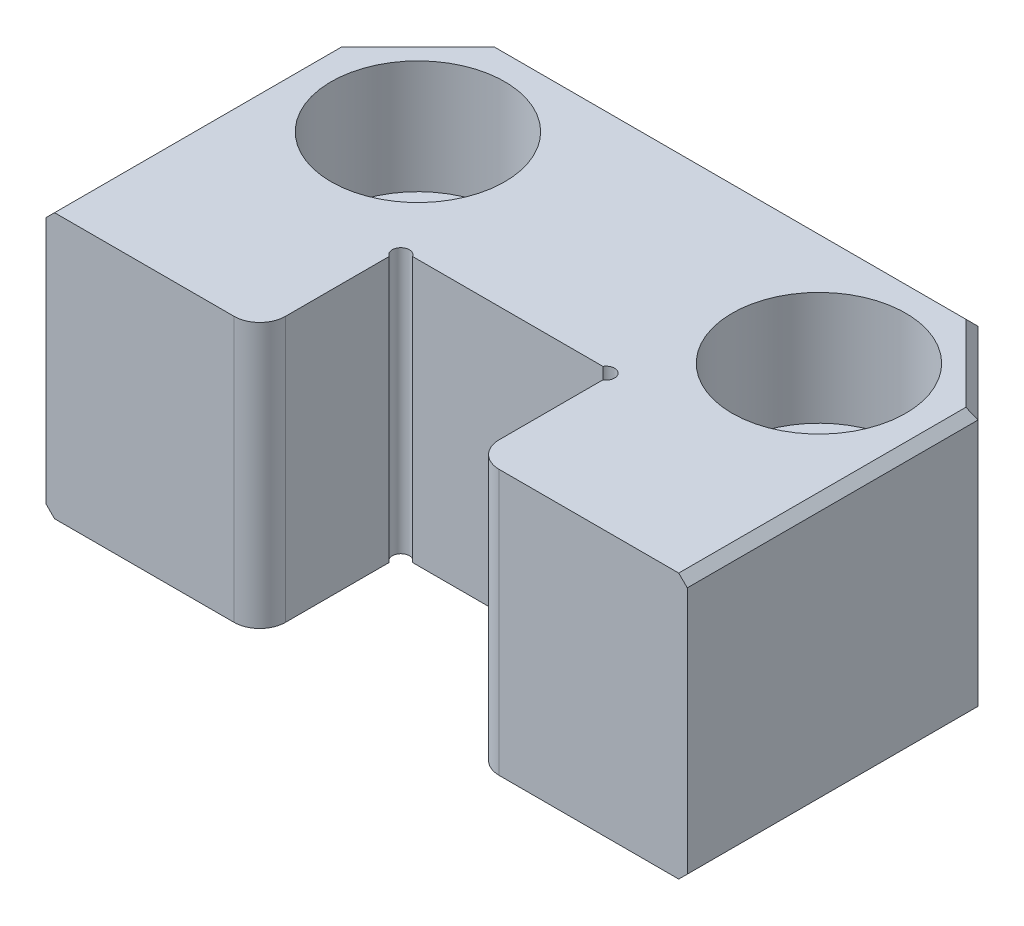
ISO-10303-21;
HEADER;
FILE_DESCRIPTION(('STEP AP214'),'2;1');
FILE_NAME('part.step','',(''),(''),'','','');
FILE_SCHEMA(('AUTOMOTIVE_DESIGN { 1 0 10303 214 1 1 1 1 }'));
ENDSEC;
DATA;
#1=APPLICATION_CONTEXT('core data for automotive mechanical design processes');
#2=APPLICATION_PROTOCOL_DEFINITION('international standard','automotive_design',2000,#1);
#3=PRODUCT_CONTEXT('',#1,'mechanical');
#4=PRODUCT('Part','Part','',(#3));
#5=PRODUCT_RELATED_PRODUCT_CATEGORY('part','',(#4));
#6=PRODUCT_DEFINITION_FORMATION('','',#4);
#7=PRODUCT_DEFINITION_CONTEXT('part definition',#1,'design');
#8=PRODUCT_DEFINITION('design','',#6,#7);
#9=PRODUCT_DEFINITION_SHAPE('','',#8);
#10=(LENGTH_UNIT() NAMED_UNIT(*) SI_UNIT(.MILLI.,.METRE.));
#11=(NAMED_UNIT(*) PLANE_ANGLE_UNIT() SI_UNIT($,.RADIAN.));
#12=(NAMED_UNIT(*) SI_UNIT($,.STERADIAN.) SOLID_ANGLE_UNIT());
#13=UNCERTAINTY_MEASURE_WITH_UNIT(LENGTH_MEASURE(1.E-05),#10,'distance_accuracy_value','');
#14=(GEOMETRIC_REPRESENTATION_CONTEXT(3) GLOBAL_UNCERTAINTY_ASSIGNED_CONTEXT((#13)) GLOBAL_UNIT_ASSIGNED_CONTEXT((#10,
#11,#12)) REPRESENTATION_CONTEXT('',''));
#15=CARTESIAN_POINT('',(0.,0.,0.));
#16=DIRECTION('',(0.,0.,1.));
#17=DIRECTION('',(1.,0.,0.));
#18=AXIS2_PLACEMENT_3D('',#15,#16,#17);
#19=CARTESIAN_POINT('',(-11.9126,15.748,-14.9606));
#20=DIRECTION('',(0.,-1.,0.));
#21=DIRECTION('',(0.,0.,-1.));
#22=AXIS2_PLACEMENT_3D('',#19,#20,#21);
#23=CYLINDRICAL_SURFACE('',#22,3.5687);
#24=CARTESIAN_POINT('',(-11.9126,0.,-14.9606));
#25=DIRECTION('',(0.,-1.,0.));
#26=DIRECTION('',(0.,0.,-1.));
#27=AXIS2_PLACEMENT_3D('',#24,#25,#26);
#28=CIRCLE('',#27,3.5687);
#29=CARTESIAN_POINT('',(-11.9126,0.,-18.5293));
#30=VERTEX_POINT('',#29);
#31=EDGE_CURVE('E319',#30,#30,#28,.T.);
#32=ORIENTED_EDGE('',*,*,#31,.T.);
#33=EDGE_LOOP('',(#32));
#34=FACE_BOUND('',#33,.T.);
#35=CARTESIAN_POINT('',(-11.9126,9.017,-14.9606));
#36=DIRECTION('',(0.,1.,0.));
#37=DIRECTION('',(0.,0.,1.));
#38=AXIS2_PLACEMENT_3D('',#35,#36,#37);
#39=CIRCLE('',#38,3.5687);
#40=CARTESIAN_POINT('',(-11.9126,9.017,-11.3919));
#41=VERTEX_POINT('',#40);
#42=EDGE_CURVE('E36',#41,#41,#39,.F.);
#43=ORIENTED_EDGE('',*,*,#42,.F.);
#44=EDGE_LOOP('',(#43));
#45=FACE_BOUND('',#44,.T.);
#46=ADVANCED_FACE('F32',(#34,#45),#23,.F.);
#47=CARTESIAN_POINT('',(11.9126,15.748,-14.9606));
#48=DIRECTION('',(0.,-1.,0.));
#49=DIRECTION('',(0.,0.,-1.));
#50=AXIS2_PLACEMENT_3D('',#47,#48,#49);
#51=CYLINDRICAL_SURFACE('',#50,3.5687);
#52=CARTESIAN_POINT('',(11.9126,0.,-14.9606));
#53=DIRECTION('',(0.,-1.,0.));
#54=DIRECTION('',(0.,0.,-1.));
#55=AXIS2_PLACEMENT_3D('',#52,#53,#54);
#56=CIRCLE('',#55,3.5687);
#57=CARTESIAN_POINT('',(11.9126,0.,-18.5293));
#58=VERTEX_POINT('',#57);
#59=EDGE_CURVE('E204',#58,#58,#56,.T.);
#60=ORIENTED_EDGE('',*,*,#59,.T.);
#61=EDGE_LOOP('',(#60));
#62=FACE_BOUND('',#61,.T.);
#63=CARTESIAN_POINT('',(11.9126,9.017,-14.9606));
#64=DIRECTION('',(0.,1.,0.));
#65=DIRECTION('',(0.,0.,1.));
#66=AXIS2_PLACEMENT_3D('',#63,#64,#65);
#67=CIRCLE('',#66,3.5687);
#68=CARTESIAN_POINT('',(11.9126,9.017,-11.3919));
#69=VERTEX_POINT('',#68);
#70=EDGE_CURVE('E323',#69,#69,#67,.F.);
#71=ORIENTED_EDGE('',*,*,#70,.F.);
#72=EDGE_LOOP('',(#71));
#73=FACE_BOUND('',#72,.T.);
#74=ADVANCED_FACE('F410',(#62,#73),#51,.F.);
#75=CARTESIAN_POINT('',(-19.05,15.748,0.));
#76=DIRECTION('',(0.,0.,-1.));
#77=DIRECTION('',(-1.,0.,0.));
#78=AXIS2_PLACEMENT_3D('',#75,#76,#77);
#79=PLANE('',#78);
#80=DIRECTION('',(0.,-1.,0.));
#81=VECTOR('',#80,1.);
#82=CARTESIAN_POINT('',(19.05,15.748,0.));
#83=LINE('',#82,#81);
#84=CARTESIAN_POINT('',(19.05,15.24,0.));
#85=VERTEX_POINT('',#84);
#86=CARTESIAN_POINT('',(19.05,0.508000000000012,0.));
#87=VERTEX_POINT('',#86);
#88=EDGE_CURVE('E220',#85,#87,#83,.T.);
#89=ORIENTED_EDGE('',*,*,#88,.F.);
#90=DIRECTION('',(-0.707106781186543,0.707106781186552,0.));
#91=VECTOR('',#90,1.);
#92=CARTESIAN_POINT('',(18.542,15.748,0.));
#93=LINE('',#92,#91);
#94=CARTESIAN_POINT('',(18.542,15.748,0.));
#95=VERTEX_POINT('',#94);
#96=EDGE_CURVE('E298',#85,#95,#93,.T.);
#97=ORIENTED_EDGE('',*,*,#96,.T.);
#98=DIRECTION('',(1.,0.,0.));
#99=VECTOR('',#98,1.);
#100=CARTESIAN_POINT('',(-19.05,15.748,0.));
#101=LINE('',#100,#99);
#102=CARTESIAN_POINT('',(7.874,15.748,0.));
#103=VERTEX_POINT('',#102);
#104=EDGE_CURVE('E221',#103,#95,#101,.T.);
#105=ORIENTED_EDGE('',*,*,#104,.F.);
#106=DIRECTION('',(0.,-1.,0.));
#107=VECTOR('',#106,1.);
#108=CARTESIAN_POINT('',(7.874,15.748,0.));
#109=LINE('',#108,#107);
#110=CARTESIAN_POINT('',(7.874,0.,0.));
#111=VERTEX_POINT('',#110);
#112=EDGE_CURVE('E242',#103,#111,#109,.T.);
#113=ORIENTED_EDGE('',*,*,#112,.T.);
#114=DIRECTION('',(1.,0.,0.));
#115=VECTOR('',#114,1.);
#116=CARTESIAN_POINT('',(-19.05,0.,0.));
#117=LINE('',#116,#115);
#118=CARTESIAN_POINT('',(18.542,0.,0.));
#119=VERTEX_POINT('',#118);
#120=EDGE_CURVE('E214',#111,#119,#117,.T.);
#121=ORIENTED_EDGE('',*,*,#120,.T.);
#122=DIRECTION('',(-0.707106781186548,-0.707106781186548,0.));
#123=VECTOR('',#122,1.);
#124=CARTESIAN_POINT('',(19.05,0.50800000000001,0.));
#125=LINE('',#124,#123);
#126=EDGE_CURVE('E296',#119,#87,#125,.F.);
#127=ORIENTED_EDGE('',*,*,#126,.T.);
#128=EDGE_LOOP('',(#89,#97,#105,#113,#121,#127));
#129=FACE_BOUND('',#128,.T.);
#130=ADVANCED_FACE('F363',(#129),#79,.F.);
#131=CARTESIAN_POINT('',(-19.05,15.748,-22.098));
#132=DIRECTION('',(1.,0.,0.));
#133=DIRECTION('',(0.,0.,-1.));
#134=AXIS2_PLACEMENT_3D('',#131,#132,#133);
#135=PLANE('',#134);
#136=DIRECTION('',(0.,-1.,0.));
#137=VECTOR('',#136,1.);
#138=CARTESIAN_POINT('',(-19.05,15.748,0.));
#139=LINE('',#138,#137);
#140=CARTESIAN_POINT('',(-19.05,15.24,0.));
#141=VERTEX_POINT('',#140);
#142=CARTESIAN_POINT('',(-19.05,0.508000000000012,0.));
#143=VERTEX_POINT('',#142);
#144=EDGE_CURVE('E226',#141,#143,#139,.T.);
#145=ORIENTED_EDGE('',*,*,#144,.F.);
#146=DIRECTION('',(0.,0.,-1.));
#147=VECTOR('',#146,1.);
#148=CARTESIAN_POINT('',(-19.05,15.24,-17.272));
#149=LINE('',#148,#147);
#150=CARTESIAN_POINT('',(-19.05,15.24,-17.272));
#151=VERTEX_POINT('',#150);
#152=EDGE_CURVE('E277',#141,#151,#149,.T.);
#153=ORIENTED_EDGE('',*,*,#152,.T.);
#154=DIRECTION('',(0.,-1.,0.));
#155=VECTOR('',#154,1.);
#156=CARTESIAN_POINT('',(-19.05,15.748,-17.272));
#157=LINE('',#156,#155);
#158=CARTESIAN_POINT('',(-19.05,0.508000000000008,-17.272));
#159=VERTEX_POINT('',#158);
#160=EDGE_CURVE('E238',#151,#159,#157,.T.);
#161=ORIENTED_EDGE('',*,*,#160,.T.);
#162=DIRECTION('',(0.,0.,1.));
#163=VECTOR('',#162,1.);
#164=CARTESIAN_POINT('',(-19.05,0.508000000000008,-22.098));
#165=LINE('',#164,#163);
#166=EDGE_CURVE('E275',#159,#143,#165,.T.);
#167=ORIENTED_EDGE('',*,*,#166,.T.);
#168=EDGE_LOOP('',(#145,#153,#161,#167));
#169=FACE_BOUND('',#168,.T.);
#170=ADVANCED_FACE('F454',(#169),#135,.F.);
#171=CARTESIAN_POINT('',(-18.542,15.748,0.));
#172=VERTEX_POINT('',#171);
#173=CARTESIAN_POINT('',(-7.874,15.748,0.));
#174=VERTEX_POINT('',#173);
#175=EDGE_CURVE('E218',#172,#174,#101,.T.);
#176=ORIENTED_EDGE('',*,*,#175,.F.);
#177=DIRECTION('',(-0.707106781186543,-0.707106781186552,0.));
#178=VECTOR('',#177,1.);
#179=CARTESIAN_POINT('',(-18.542,15.748,0.));
#180=LINE('',#179,#178);
#181=EDGE_CURVE('E273',#172,#141,#180,.T.);
#182=ORIENTED_EDGE('',*,*,#181,.T.);
#183=ORIENTED_EDGE('',*,*,#144,.T.);
#184=DIRECTION('',(-0.707106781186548,0.707106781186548,0.));
#185=VECTOR('',#184,1.);
#186=CARTESIAN_POINT('',(-19.05,0.50800000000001,0.));
#187=LINE('',#186,#185);
#188=CARTESIAN_POINT('',(-18.542,0.,0.));
#189=VERTEX_POINT('',#188);
#190=EDGE_CURVE('E271',#143,#189,#187,.F.);
#191=ORIENTED_EDGE('',*,*,#190,.T.);
#192=CARTESIAN_POINT('',(-7.874,0.,0.));
#193=VERTEX_POINT('',#192);
#194=EDGE_CURVE('E222',#189,#193,#117,.T.);
#195=ORIENTED_EDGE('',*,*,#194,.T.);
#196=DIRECTION('',(0.,1.,0.));
#197=VECTOR('',#196,1.);
#198=CARTESIAN_POINT('',(-7.874,15.748,0.));
#199=LINE('',#198,#197);
#200=EDGE_CURVE('E255',#193,#174,#199,.T.);
#201=ORIENTED_EDGE('',*,*,#200,.T.);
#202=EDGE_LOOP('',(#176,#182,#183,#191,#195,#201));
#203=FACE_BOUND('',#202,.T.);
#204=ADVANCED_FACE('F451',(#203),#79,.F.);
#205=CARTESIAN_POINT('',(19.05,15.748,-22.098));
#206=DIRECTION('',(-1.,0.,0.));
#207=DIRECTION('',(0.,0.,1.));
#208=AXIS2_PLACEMENT_3D('',#205,#206,#207);
#209=PLANE('',#208);
#210=DIRECTION('',(0.,1.,0.));
#211=VECTOR('',#210,1.);
#212=CARTESIAN_POINT('',(19.05,15.748,-17.272));
#213=LINE('',#212,#211);
#214=CARTESIAN_POINT('',(19.05,0.508000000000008,-17.272));
#215=VERTEX_POINT('',#214);
#216=CARTESIAN_POINT('',(19.05,15.24,-17.272));
#217=VERTEX_POINT('',#216);
#218=EDGE_CURVE('E235',#215,#217,#213,.T.);
#219=ORIENTED_EDGE('',*,*,#218,.T.);
#220=DIRECTION('',(0.,0.,1.));
#221=VECTOR('',#220,1.);
#222=CARTESIAN_POINT('',(19.05,15.24,0.));
#223=LINE('',#222,#221);
#224=EDGE_CURVE('E294',#217,#85,#223,.T.);
#225=ORIENTED_EDGE('',*,*,#224,.T.);
#226=ORIENTED_EDGE('',*,*,#88,.T.);
#227=DIRECTION('',(0.,0.,-1.));
#228=VECTOR('',#227,1.);
#229=CARTESIAN_POINT('',(19.05,0.508000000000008,-22.098));
#230=LINE('',#229,#228);
#231=EDGE_CURVE('E291',#87,#215,#230,.T.);
#232=ORIENTED_EDGE('',*,*,#231,.T.);
#233=EDGE_LOOP('',(#219,#225,#226,#232));
#234=FACE_BOUND('',#233,.T.);
#235=ADVANCED_FACE('F378',(#234),#209,.F.);
#236=CARTESIAN_POINT('',(-19.05,15.748,-22.098));
#237=DIRECTION('',(0.,0.,1.));
#238=DIRECTION('',(1.,0.,0.));
#239=AXIS2_PLACEMENT_3D('',#236,#237,#238);
#240=PLANE('',#239);
#241=DIRECTION('',(0.,1.,0.));
#242=VECTOR('',#241,1.);
#243=CARTESIAN_POINT('',(-14.224,15.748,-22.098));
#244=LINE('',#243,#242);
#245=CARTESIAN_POINT('',(-14.224,0.508000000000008,-22.098));
#246=VERTEX_POINT('',#245);
#247=CARTESIAN_POINT('',(-14.224,15.24,-22.098));
#248=VERTEX_POINT('',#247);
#249=EDGE_CURVE('E229',#246,#248,#244,.T.);
#250=ORIENTED_EDGE('',*,*,#249,.T.);
#251=DIRECTION('',(1.,0.,0.));
#252=VECTOR('',#251,1.);
#253=CARTESIAN_POINT('',(14.224,15.24,-22.098));
#254=LINE('',#253,#252);
#255=CARTESIAN_POINT('',(14.224,15.24,-22.098));
#256=VERTEX_POINT('',#255);
#257=EDGE_CURVE('E285',#248,#256,#254,.T.);
#258=ORIENTED_EDGE('',*,*,#257,.T.);
#259=DIRECTION('',(0.,-1.,0.));
#260=VECTOR('',#259,1.);
#261=CARTESIAN_POINT('',(14.224,15.748,-22.098));
#262=LINE('',#261,#260);
#263=CARTESIAN_POINT('',(14.224,0.508000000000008,-22.098));
#264=VERTEX_POINT('',#263);
#265=EDGE_CURVE('E232',#256,#264,#262,.T.);
#266=ORIENTED_EDGE('',*,*,#265,.T.);
#267=DIRECTION('',(-1.,0.,0.));
#268=VECTOR('',#267,1.);
#269=CARTESIAN_POINT('',(-19.05,0.508000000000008,-22.098));
#270=LINE('',#269,#268);
#271=EDGE_CURVE('E283',#264,#246,#270,.T.);
#272=ORIENTED_EDGE('',*,*,#271,.T.);
#273=EDGE_LOOP('',(#250,#258,#266,#272));
#274=FACE_BOUND('',#273,.T.);
#275=ADVANCED_FACE('F441',(#274),#240,.F.);
#276=CARTESIAN_POINT('',(-19.05,15.748,-22.098));
#277=DIRECTION('',(0.,1.,0.));
#278=DIRECTION('',(0.,0.,1.));
#279=AXIS2_PLACEMENT_3D('',#276,#277,#278);
#280=PLANE('',#279);
#281=CARTESIAN_POINT('',(-11.9126,15.748,-14.9606));
#282=DIRECTION('',(0.,1.,0.));
#283=DIRECTION('',(0.,0.,1.));
#284=AXIS2_PLACEMENT_3D('',#281,#282,#283);
#285=CIRCLE('',#284,5.1562);
#286=CARTESIAN_POINT('',(-11.9126,15.748,-9.8044));
#287=VERTEX_POINT('',#286);
#288=EDGE_CURVE('E342',#287,#287,#285,.T.);
#289=ORIENTED_EDGE('',*,*,#288,.F.);
#290=EDGE_LOOP('',(#289));
#291=FACE_BOUND('',#290,.T.);
#292=CARTESIAN_POINT('',(11.9126,15.748,-14.9606));
#293=DIRECTION('',(0.,1.,0.));
#294=DIRECTION('',(0.,0.,1.));
#295=AXIS2_PLACEMENT_3D('',#292,#293,#294);
#296=CIRCLE('',#295,5.1562);
#297=CARTESIAN_POINT('',(11.9126,15.748,-9.8044));
#298=VERTEX_POINT('',#297);
#299=EDGE_CURVE('E335',#298,#298,#296,.T.);
#300=ORIENTED_EDGE('',*,*,#299,.F.);
#301=EDGE_LOOP('',(#300));
#302=FACE_BOUND('',#301,.T.);
#303=DIRECTION('',(-0.707106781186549,0.,0.707106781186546));
#304=VECTOR('',#303,1.);
#305=CARTESIAN_POINT('',(-16.2777897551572,15.748,-19.3257897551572));
#306=LINE('',#305,#304);
#307=CARTESIAN_POINT('',(-14.0135795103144,15.748,-21.59));
#308=VERTEX_POINT('',#307);
#309=CARTESIAN_POINT('',(-18.542,15.748,-17.0615795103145));
#310=VERTEX_POINT('',#309);
#311=EDGE_CURVE('E266',#308,#310,#306,.T.);
#312=ORIENTED_EDGE('',*,*,#311,.T.);
#313=DIRECTION('',(0.,0.,1.));
#314=VECTOR('',#313,1.);
#315=CARTESIAN_POINT('',(-18.542,15.748,0.));
#316=LINE('',#315,#314);
#317=EDGE_CURVE('E268',#310,#172,#316,.T.);
#318=ORIENTED_EDGE('',*,*,#317,.T.);
#319=ORIENTED_EDGE('',*,*,#175,.T.);
#320=CARTESIAN_POINT('',(-7.874,15.748,-1.524));
#321=DIRECTION('',(0.,1.,0.));
#322=DIRECTION('',(0.,0.,1.));
#323=AXIS2_PLACEMENT_3D('',#320,#321,#322);
#324=CIRCLE('',#323,1.524);
#325=CARTESIAN_POINT('',(-6.35,15.748,-1.524));
#326=VERTEX_POINT('',#325);
#327=EDGE_CURVE('E175',#174,#326,#324,.T.);
#328=ORIENTED_EDGE('',*,*,#327,.T.);
#329=DIRECTION('',(0.,0.,-1.));
#330=VECTOR('',#329,1.);
#331=CARTESIAN_POINT('',(-6.35,15.748,-7.6880590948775));
#332=LINE('',#331,#330);
#333=CARTESIAN_POINT('',(-6.35,15.748,-7.6880590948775));
#334=VERTEX_POINT('',#333);
#335=EDGE_CURVE('E168',#326,#334,#332,.T.);
#336=ORIENTED_EDGE('',*,*,#335,.T.);
#337=CARTESIAN_POINT('',(-6.096,15.748,-8.128));
#338=DIRECTION('',(0.,-1.,0.));
#339=DIRECTION('',(0.,0.,-1.));
#340=AXIS2_PLACEMENT_3D('',#337,#338,#339);
#341=CIRCLE('',#340,0.508);
#342=CARTESIAN_POINT('',(-5.65605909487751,15.748,-8.382));
#343=VERTEX_POINT('',#342);
#344=EDGE_CURVE('E173',#334,#343,#341,.T.);
#345=ORIENTED_EDGE('',*,*,#344,.T.);
#346=DIRECTION('',(1.,0.,0.));
#347=VECTOR('',#346,1.);
#348=CARTESIAN_POINT('',(-5.65605909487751,15.748,-8.382));
#349=LINE('',#348,#347);
#350=CARTESIAN_POINT('',(5.65605909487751,15.748,-8.382));
#351=VERTEX_POINT('',#350);
#352=EDGE_CURVE('E193',#343,#351,#349,.T.);
#353=ORIENTED_EDGE('',*,*,#352,.T.);
#354=CARTESIAN_POINT('',(6.096,15.748,-8.128));
#355=DIRECTION('',(0.,-1.,0.));
#356=DIRECTION('',(0.,0.,-1.));
#357=AXIS2_PLACEMENT_3D('',#354,#355,#356);
#358=CIRCLE('',#357,0.508);
#359=CARTESIAN_POINT('',(6.35,15.748,-7.6880590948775));
#360=VERTEX_POINT('',#359);
#361=EDGE_CURVE('E189',#351,#360,#358,.T.);
#362=ORIENTED_EDGE('',*,*,#361,.T.);
#363=DIRECTION('',(0.,0.,1.));
#364=VECTOR('',#363,1.);
#365=CARTESIAN_POINT('',(6.35,15.748,-7.6880590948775));
#366=LINE('',#365,#364);
#367=CARTESIAN_POINT('',(6.35,15.748,-1.524));
#368=VERTEX_POINT('',#367);
#369=EDGE_CURVE('E178',#360,#368,#366,.T.);
#370=ORIENTED_EDGE('',*,*,#369,.T.);
#371=CARTESIAN_POINT('',(7.874,15.748,-1.524));
#372=DIRECTION('',(0.,1.,0.));
#373=DIRECTION('',(0.,0.,1.));
#374=AXIS2_PLACEMENT_3D('',#371,#372,#373);
#375=CIRCLE('',#374,1.524);
#376=EDGE_CURVE('E253',#368,#103,#375,.T.);
#377=ORIENTED_EDGE('',*,*,#376,.T.);
#378=ORIENTED_EDGE('',*,*,#104,.T.);
#379=DIRECTION('',(0.,0.,-1.));
#380=VECTOR('',#379,1.);
#381=CARTESIAN_POINT('',(18.542,15.748,-17.272));
#382=LINE('',#381,#380);
#383=CARTESIAN_POINT('',(18.542,15.748,-17.0615795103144));
#384=VERTEX_POINT('',#383);
#385=EDGE_CURVE('E260',#95,#384,#382,.T.);
#386=ORIENTED_EDGE('',*,*,#385,.T.);
#387=DIRECTION('',(-0.707106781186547,0.,-0.707106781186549));
#388=VECTOR('',#387,1.);
#389=CARTESIAN_POINT('',(-2.77221024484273,15.748,-38.3757897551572));
#390=LINE('',#389,#388);
#391=CARTESIAN_POINT('',(14.0135795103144,15.748,-21.59));
#392=VERTEX_POINT('',#391);
#393=EDGE_CURVE('E262',#384,#392,#390,.T.);
#394=ORIENTED_EDGE('',*,*,#393,.T.);
#395=DIRECTION('',(-1.,0.,0.));
#396=VECTOR('',#395,1.);
#397=CARTESIAN_POINT('',(-14.224,15.748,-21.59));
#398=LINE('',#397,#396);
#399=EDGE_CURVE('E264',#392,#308,#398,.T.);
#400=ORIENTED_EDGE('',*,*,#399,.T.);
#401=EDGE_LOOP('',(#312,#318,#319,#328,#336,#345,#353,#362,#370,#377,#378,#386,#394,#400));
#402=FACE_BOUND('',#401,.T.);
#403=ADVANCED_FACE('F170',(#291,#302,#402),#280,.T.);
#404=CARTESIAN_POINT('',(-19.05,0.,-22.098));
#405=DIRECTION('',(0.,1.,0.));
#406=DIRECTION('',(0.,0.,1.));
#407=AXIS2_PLACEMENT_3D('',#404,#405,#406);
#408=PLANE('',#407);
#409=ORIENTED_EDGE('',*,*,#31,.F.);
#410=EDGE_LOOP('',(#409));
#411=FACE_BOUND('',#410,.T.);
#412=ORIENTED_EDGE('',*,*,#59,.F.);
#413=EDGE_LOOP('',(#412));
#414=FACE_BOUND('',#413,.T.);
#415=DIRECTION('',(0.707106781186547,0.,0.707106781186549));
#416=VECTOR('',#415,1.);
#417=CARTESIAN_POINT('',(18.6907897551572,0.,-16.9127897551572));
#418=LINE('',#417,#416);
#419=CARTESIAN_POINT('',(14.0135795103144,0.,-21.59));
#420=VERTEX_POINT('',#419);
#421=CARTESIAN_POINT('',(18.542,0.,-17.0615795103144));
#422=VERTEX_POINT('',#421);
#423=EDGE_CURVE('E41',#420,#422,#418,.T.);
#424=ORIENTED_EDGE('',*,*,#423,.T.);
#425=DIRECTION('',(0.,0.,1.));
#426=VECTOR('',#425,1.);
#427=CARTESIAN_POINT('',(18.542,0.,-22.098));
#428=LINE('',#427,#426);
#429=EDGE_CURVE('E11',#422,#119,#428,.T.);
#430=ORIENTED_EDGE('',*,*,#429,.T.);
#431=ORIENTED_EDGE('',*,*,#120,.F.);
#432=CARTESIAN_POINT('',(7.874,0.,-1.524));
#433=DIRECTION('',(0.,1.,0.));
#434=DIRECTION('',(0.,0.,1.));
#435=AXIS2_PLACEMENT_3D('',#432,#433,#434);
#436=CIRCLE('',#435,1.524);
#437=CARTESIAN_POINT('',(6.35,0.,-1.524));
#438=VERTEX_POINT('',#437);
#439=EDGE_CURVE('E248',#111,#438,#436,.F.);
#440=ORIENTED_EDGE('',*,*,#439,.T.);
#441=DIRECTION('',(0.,0.,1.));
#442=VECTOR('',#441,1.);
#443=CARTESIAN_POINT('',(6.35,0.,-7.6880590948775));
#444=LINE('',#443,#442);
#445=CARTESIAN_POINT('',(6.35,0.,-7.6880590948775));
#446=VERTEX_POINT('',#445);
#447=EDGE_CURVE('E200',#446,#438,#444,.T.);
#448=ORIENTED_EDGE('',*,*,#447,.F.);
#449=CARTESIAN_POINT('',(6.096,0.,-8.128));
#450=DIRECTION('',(0.,-1.,0.));
#451=DIRECTION('',(0.,0.,-1.));
#452=AXIS2_PLACEMENT_3D('',#449,#450,#451);
#453=CIRCLE('',#452,0.508);
#454=CARTESIAN_POINT('',(5.65605909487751,0.,-8.382));
#455=VERTEX_POINT('',#454);
#456=EDGE_CURVE('E209',#455,#446,#453,.T.);
#457=ORIENTED_EDGE('',*,*,#456,.F.);
#458=DIRECTION('',(1.,0.,0.));
#459=VECTOR('',#458,1.);
#460=CARTESIAN_POINT('',(-5.65605909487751,0.,-8.382));
#461=LINE('',#460,#459);
#462=CARTESIAN_POINT('',(-5.65605909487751,0.,-8.382));
#463=VERTEX_POINT('',#462);
#464=EDGE_CURVE('E206',#463,#455,#461,.T.);
#465=ORIENTED_EDGE('',*,*,#464,.F.);
#466=CARTESIAN_POINT('',(-6.096,0.,-8.128));
#467=DIRECTION('',(0.,-1.,0.));
#468=DIRECTION('',(0.,0.,-1.));
#469=AXIS2_PLACEMENT_3D('',#466,#467,#468);
#470=CIRCLE('',#469,0.508);
#471=CARTESIAN_POINT('',(-6.35,0.,-7.6880590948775));
#472=VERTEX_POINT('',#471);
#473=EDGE_CURVE('E203',#472,#463,#470,.T.);
#474=ORIENTED_EDGE('',*,*,#473,.F.);
#475=DIRECTION('',(0.,0.,1.));
#476=VECTOR('',#475,1.);
#477=CARTESIAN_POINT('',(-6.35,0.,-22.098));
#478=LINE('',#477,#476);
#479=CARTESIAN_POINT('',(-6.35,0.,-1.524));
#480=VERTEX_POINT('',#479);
#481=EDGE_CURVE('E184',#472,#480,#478,.T.);
#482=ORIENTED_EDGE('',*,*,#481,.T.);
#483=CARTESIAN_POINT('',(-7.874,0.,-1.524));
#484=DIRECTION('',(0.,1.,0.));
#485=DIRECTION('',(0.,0.,1.));
#486=AXIS2_PLACEMENT_3D('',#483,#484,#485);
#487=CIRCLE('',#486,1.524);
#488=EDGE_CURVE('E245',#480,#193,#487,.F.);
#489=ORIENTED_EDGE('',*,*,#488,.T.);
#490=ORIENTED_EDGE('',*,*,#194,.F.);
#491=DIRECTION('',(0.,0.,-1.));
#492=VECTOR('',#491,1.);
#493=CARTESIAN_POINT('',(-18.542,0.,-22.098));
#494=LINE('',#493,#492);
#495=CARTESIAN_POINT('',(-18.542,0.,-17.0615795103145));
#496=VERTEX_POINT('',#495);
#497=EDGE_CURVE('E300',#189,#496,#494,.T.);
#498=ORIENTED_EDGE('',*,*,#497,.T.);
#499=DIRECTION('',(0.707106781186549,0.,-0.707106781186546));
#500=VECTOR('',#499,1.);
#501=CARTESIAN_POINT('',(-13.8647897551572,0.,-21.7387897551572));
#502=LINE('',#501,#500);
#503=CARTESIAN_POINT('',(-14.0135795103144,0.,-21.59));
#504=VERTEX_POINT('',#503);
#505=EDGE_CURVE('E302',#496,#504,#502,.T.);
#506=ORIENTED_EDGE('',*,*,#505,.T.);
#507=DIRECTION('',(1.,0.,0.));
#508=VECTOR('',#507,1.);
#509=CARTESIAN_POINT('',(-19.05,0.,-21.59));
#510=LINE('',#509,#508);
#511=EDGE_CURVE('E52',#504,#420,#510,.T.);
#512=ORIENTED_EDGE('',*,*,#511,.T.);
#513=EDGE_LOOP('',(#424,#430,#431,#440,#448,#457,#465,#474,#482,#489,#490,#498,#506,#512));
#514=FACE_BOUND('',#513,.T.);
#515=ADVANCED_FACE('F365',(#411,#414,#514),#408,.F.);
#516=CARTESIAN_POINT('',(14.224,15.748,-22.098));
#517=DIRECTION('',(-0.707106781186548,0.,0.707106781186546));
#518=DIRECTION('',(0.707106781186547,0.,0.707106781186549));
#519=AXIS2_PLACEMENT_3D('',#516,#517,#518);
#520=PLANE('',#519);
#521=ORIENTED_EDGE('',*,*,#265,.F.);
#522=DIRECTION('',(-0.707106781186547,0.,-0.707106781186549));
#523=VECTOR('',#522,1.);
#524=CARTESIAN_POINT('',(14.224,15.24,-22.098));
#525=LINE('',#524,#523);
#526=EDGE_CURVE('E289',#256,#217,#525,.F.);
#527=ORIENTED_EDGE('',*,*,#526,.T.);
#528=ORIENTED_EDGE('',*,*,#218,.F.);
#529=DIRECTION('',(0.707106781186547,0.,0.707106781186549));
#530=VECTOR('',#529,1.);
#531=CARTESIAN_POINT('',(14.224,0.508000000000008,-22.098));
#532=LINE('',#531,#530);
#533=EDGE_CURVE('E287',#215,#264,#532,.F.);
#534=ORIENTED_EDGE('',*,*,#533,.T.);
#535=EDGE_LOOP('',(#521,#527,#528,#534));
#536=FACE_BOUND('',#535,.T.);
#537=ADVANCED_FACE('F380',(#536),#520,.F.);
#538=CARTESIAN_POINT('',(-19.05,15.748,-17.272));
#539=DIRECTION('',(0.707106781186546,0.,0.707106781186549));
#540=DIRECTION('',(0.707106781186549,0.,-0.707106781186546));
#541=AXIS2_PLACEMENT_3D('',#538,#539,#540);
#542=PLANE('',#541);
#543=ORIENTED_EDGE('',*,*,#160,.F.);
#544=DIRECTION('',(-0.707106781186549,0.,0.707106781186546));
#545=VECTOR('',#544,1.);
#546=CARTESIAN_POINT('',(-19.05,15.24,-17.272));
#547=LINE('',#546,#545);
#548=EDGE_CURVE('E281',#151,#248,#547,.F.);
#549=ORIENTED_EDGE('',*,*,#548,.T.);
#550=ORIENTED_EDGE('',*,*,#249,.F.);
#551=DIRECTION('',(0.707106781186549,0.,-0.707106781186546));
#552=VECTOR('',#551,1.);
#553=CARTESIAN_POINT('',(-19.05,0.508000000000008,-17.272));
#554=LINE('',#553,#552);
#555=EDGE_CURVE('E279',#246,#159,#554,.F.);
#556=ORIENTED_EDGE('',*,*,#555,.T.);
#557=EDGE_LOOP('',(#543,#549,#550,#556));
#558=FACE_BOUND('',#557,.T.);
#559=ADVANCED_FACE('F438',(#558),#542,.F.);
#560=CARTESIAN_POINT('',(6.35,15.748,-7.6880590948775));
#561=DIRECTION('',(1.,0.,0.));
#562=DIRECTION('',(0.,0.,-1.));
#563=AXIS2_PLACEMENT_3D('',#560,#561,#562);
#564=PLANE('',#563);
#565=ORIENTED_EDGE('',*,*,#447,.T.);
#566=DIRECTION('',(0.,-1.,0.));
#567=VECTOR('',#566,1.);
#568=CARTESIAN_POINT('',(6.35,15.748,-1.524));
#569=LINE('',#568,#567);
#570=EDGE_CURVE('E250',#438,#368,#569,.F.);
#571=ORIENTED_EDGE('',*,*,#570,.T.);
#572=ORIENTED_EDGE('',*,*,#369,.F.);
#573=DIRECTION('',(0.,-1.,0.));
#574=VECTOR('',#573,1.);
#575=CARTESIAN_POINT('',(6.35,15.748,-7.6880590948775));
#576=LINE('',#575,#574);
#577=EDGE_CURVE('E212',#360,#446,#576,.T.);
#578=ORIENTED_EDGE('',*,*,#577,.T.);
#579=EDGE_LOOP('',(#565,#571,#572,#578));
#580=FACE_BOUND('',#579,.T.);
#581=ADVANCED_FACE('F435',(#580),#564,.F.);
#582=CARTESIAN_POINT('',(-6.35,15.748,-7.6880590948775));
#583=DIRECTION('',(-1.,0.,0.));
#584=DIRECTION('',(0.,0.,1.));
#585=AXIS2_PLACEMENT_3D('',#582,#583,#584);
#586=PLANE('',#585);
#587=ORIENTED_EDGE('',*,*,#335,.F.);
#588=DIRECTION('',(0.,1.,0.));
#589=VECTOR('',#588,1.);
#590=CARTESIAN_POINT('',(-6.35,15.748,-1.524));
#591=LINE('',#590,#589);
#592=EDGE_CURVE('E258',#326,#480,#591,.F.);
#593=ORIENTED_EDGE('',*,*,#592,.T.);
#594=ORIENTED_EDGE('',*,*,#481,.F.);
#595=DIRECTION('',(0.,-1.,0.));
#596=VECTOR('',#595,1.);
#597=CARTESIAN_POINT('',(-6.35,15.748,-7.6880590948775));
#598=LINE('',#597,#596);
#599=EDGE_CURVE('E181',#334,#472,#598,.T.);
#600=ORIENTED_EDGE('',*,*,#599,.F.);
#601=EDGE_LOOP('',(#587,#593,#594,#600));
#602=FACE_BOUND('',#601,.T.);
#603=ADVANCED_FACE('F182',(#602),#586,.F.);
#604=CARTESIAN_POINT('',(6.096,15.748,-8.128));
#605=DIRECTION('',(0.,-1.,0.));
#606=DIRECTION('',(0.,0.,-1.));
#607=AXIS2_PLACEMENT_3D('',#604,#605,#606);
#608=CYLINDRICAL_SURFACE('',#607,0.508);
#609=ORIENTED_EDGE('',*,*,#456,.T.);
#610=ORIENTED_EDGE('',*,*,#577,.F.);
#611=ORIENTED_EDGE('',*,*,#361,.F.);
#612=DIRECTION('',(0.,-1.,0.));
#613=VECTOR('',#612,1.);
#614=CARTESIAN_POINT('',(5.65605909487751,15.748,-8.382));
#615=LINE('',#614,#613);
#616=EDGE_CURVE('E215',#351,#455,#615,.T.);
#617=ORIENTED_EDGE('',*,*,#616,.T.);
#618=EDGE_LOOP('',(#609,#610,#611,#617));
#619=FACE_BOUND('',#618,.T.);
#620=ADVANCED_FACE('F423',(#619),#608,.F.);
#621=CARTESIAN_POINT('',(-5.65605909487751,15.748,-8.382));
#622=DIRECTION('',(0.,0.,-1.));
#623=DIRECTION('',(-1.,0.,0.));
#624=AXIS2_PLACEMENT_3D('',#621,#622,#623);
#625=PLANE('',#624);
#626=ORIENTED_EDGE('',*,*,#464,.T.);
#627=ORIENTED_EDGE('',*,*,#616,.F.);
#628=ORIENTED_EDGE('',*,*,#352,.F.);
#629=DIRECTION('',(0.,-1.,0.));
#630=VECTOR('',#629,1.);
#631=CARTESIAN_POINT('',(-5.65605909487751,15.748,-8.382));
#632=LINE('',#631,#630);
#633=EDGE_CURVE('E188',#343,#463,#632,.T.);
#634=ORIENTED_EDGE('',*,*,#633,.T.);
#635=EDGE_LOOP('',(#626,#627,#628,#634));
#636=FACE_BOUND('',#635,.T.);
#637=ADVANCED_FACE('F426',(#636),#625,.F.);
#638=CARTESIAN_POINT('',(-6.096,15.748,-8.128));
#639=DIRECTION('',(0.,-1.,0.));
#640=DIRECTION('',(0.,0.,-1.));
#641=AXIS2_PLACEMENT_3D('',#638,#639,#640);
#642=CYLINDRICAL_SURFACE('',#641,0.508);
#643=ORIENTED_EDGE('',*,*,#473,.T.);
#644=ORIENTED_EDGE('',*,*,#633,.F.);
#645=ORIENTED_EDGE('',*,*,#344,.F.);
#646=ORIENTED_EDGE('',*,*,#599,.T.);
#647=EDGE_LOOP('',(#643,#644,#645,#646));
#648=FACE_BOUND('',#647,.T.);
#649=ADVANCED_FACE('F191',(#648),#642,.F.);
#650=CARTESIAN_POINT('',(7.874,15.748,-1.524));
#651=DIRECTION('',(0.,-1.,0.));
#652=DIRECTION('',(0.,0.,-1.));
#653=AXIS2_PLACEMENT_3D('',#650,#651,#652);
#654=CYLINDRICAL_SURFACE('',#653,1.524);
#655=ORIENTED_EDGE('',*,*,#376,.F.);
#656=ORIENTED_EDGE('',*,*,#570,.F.);
#657=ORIENTED_EDGE('',*,*,#439,.F.);
#658=ORIENTED_EDGE('',*,*,#112,.F.);
#659=EDGE_LOOP('',(#655,#656,#657,#658));
#660=FACE_BOUND('',#659,.T.);
#661=ADVANCED_FACE('F358',(#660),#654,.T.);
#662=CARTESIAN_POINT('',(-7.874,15.748,-1.524));
#663=DIRECTION('',(0.,1.,0.));
#664=DIRECTION('',(0.,0.,1.));
#665=AXIS2_PLACEMENT_3D('',#662,#663,#664);
#666=CYLINDRICAL_SURFACE('',#665,1.524);
#667=ORIENTED_EDGE('',*,*,#488,.F.);
#668=ORIENTED_EDGE('',*,*,#592,.F.);
#669=ORIENTED_EDGE('',*,*,#327,.F.);
#670=ORIENTED_EDGE('',*,*,#200,.F.);
#671=EDGE_LOOP('',(#667,#668,#669,#670));
#672=FACE_BOUND('',#671,.T.);
#673=ADVANCED_FACE('F399',(#672),#666,.T.);
#674=CARTESIAN_POINT('',(18.542,15.748,-22.098));
#675=DIRECTION('',(0.707106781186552,0.707106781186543,0.));
#676=DIRECTION('',(-0.707106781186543,0.707106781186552,0.));
#677=AXIS2_PLACEMENT_3D('',#674,#675,#676);
#678=PLANE('',#677);
#679=ORIENTED_EDGE('',*,*,#96,.F.);
#680=ORIENTED_EDGE('',*,*,#224,.F.);
#681=DIRECTION('',(-0.678598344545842,0.678598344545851,0.281084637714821));
#682=VECTOR('',#681,1.);
#683=CARTESIAN_POINT('',(19.5026648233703,14.7873351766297,-17.4594999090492));
#684=LINE('',#683,#682);
#685=EDGE_CURVE('E316',#384,#217,#684,.F.);
#686=ORIENTED_EDGE('',*,*,#685,.F.);
#687=ORIENTED_EDGE('',*,*,#385,.F.);
#688=EDGE_LOOP('',(#679,#680,#686,#687));
#689=FACE_BOUND('',#688,.T.);
#690=ADVANCED_FACE('F397',(#689),#678,.T.);
#691=CARTESIAN_POINT('',(-2.77221024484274,15.748,-38.3757897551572));
#692=DIRECTION('',(0.500000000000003,0.707106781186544,-0.500000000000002));
#693=DIRECTION('',(-0.816496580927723,0.57735026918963,0.));
#694=AXIS2_PLACEMENT_3D('',#691,#692,#693);
#695=PLANE('',#694);
#696=ORIENTED_EDGE('',*,*,#685,.T.);
#697=ORIENTED_EDGE('',*,*,#526,.F.);
#698=DIRECTION('',(-0.281084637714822,0.678598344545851,0.678598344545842));
#699=VECTOR('',#698,1.);
#700=CARTESIAN_POINT('',(15.8891396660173,11.2199972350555,-26.1180027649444));
#701=LINE('',#700,#699);
#702=EDGE_CURVE('E313',#392,#256,#701,.F.);
#703=ORIENTED_EDGE('',*,*,#702,.F.);
#704=ORIENTED_EDGE('',*,*,#393,.F.);
#705=EDGE_LOOP('',(#696,#697,#703,#704));
#706=FACE_BOUND('',#705,.T.);
#707=ADVANCED_FACE('F384',(#706),#695,.T.);
#708=CARTESIAN_POINT('',(-19.05,15.748,-21.59));
#709=DIRECTION('',(0.,0.707106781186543,-0.707106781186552));
#710=DIRECTION('',(0.,0.707106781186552,0.707106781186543));
#711=AXIS2_PLACEMENT_3D('',#708,#709,#710);
#712=PLANE('',#711);
#713=ORIENTED_EDGE('',*,*,#702,.T.);
#714=ORIENTED_EDGE('',*,*,#257,.F.);
#715=DIRECTION('',(0.281084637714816,0.678598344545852,0.678598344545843));
#716=VECTOR('',#715,1.);
#717=CARTESIAN_POINT('',(-14.4114999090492,14.7873351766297,-22.5506648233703));
#718=LINE('',#717,#716);
#719=EDGE_CURVE('E309',#308,#248,#718,.F.);
#720=ORIENTED_EDGE('',*,*,#719,.F.);
#721=ORIENTED_EDGE('',*,*,#399,.F.);
#722=EDGE_LOOP('',(#713,#714,#720,#721));
#723=FACE_BOUND('',#722,.T.);
#724=ADVANCED_FACE('F390',(#723),#712,.T.);
#725=CARTESIAN_POINT('',(-16.2777897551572,15.748,-19.3257897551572));
#726=DIRECTION('',(-0.500000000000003,0.707106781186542,-0.500000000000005));
#727=DIRECTION('',(0.,0.577350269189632,0.816496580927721));
#728=AXIS2_PLACEMENT_3D('',#725,#726,#727);
#729=PLANE('',#728);
#730=ORIENTED_EDGE('',*,*,#719,.T.);
#731=ORIENTED_EDGE('',*,*,#548,.F.);
#732=DIRECTION('',(0.678598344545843,0.678598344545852,0.281084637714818));
#733=VECTOR('',#732,1.);
#734=CARTESIAN_POINT('',(-17.9312244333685,16.3587755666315,-16.8085879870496));
#735=LINE('',#734,#733);
#736=EDGE_CURVE('E306',#310,#151,#735,.F.);
#737=ORIENTED_EDGE('',*,*,#736,.F.);
#738=ORIENTED_EDGE('',*,*,#311,.F.);
#739=EDGE_LOOP('',(#730,#731,#737,#738));
#740=FACE_BOUND('',#739,.T.);
#741=ADVANCED_FACE('F469',(#740),#729,.T.);
#742=CARTESIAN_POINT('',(-18.542,15.748,-22.098));
#743=DIRECTION('',(-0.707106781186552,0.707106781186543,0.));
#744=DIRECTION('',(-0.707106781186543,-0.707106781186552,0.));
#745=AXIS2_PLACEMENT_3D('',#742,#743,#744);
#746=PLANE('',#745);
#747=ORIENTED_EDGE('',*,*,#736,.T.);
#748=ORIENTED_EDGE('',*,*,#152,.F.);
#749=ORIENTED_EDGE('',*,*,#181,.F.);
#750=ORIENTED_EDGE('',*,*,#317,.F.);
#751=EDGE_LOOP('',(#747,#748,#749,#750));
#752=FACE_BOUND('',#751,.T.);
#753=ADVANCED_FACE('F466',(#752),#746,.T.);
#754=CARTESIAN_POINT('',(-19.05,0.508000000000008,-22.098));
#755=DIRECTION('',(0.707106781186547,0.707106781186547,0.));
#756=DIRECTION('',(-0.707106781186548,0.707106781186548,0.));
#757=AXIS2_PLACEMENT_3D('',#754,#755,#756);
#758=PLANE('',#757);
#759=ORIENTED_EDGE('',*,*,#190,.F.);
#760=ORIENTED_EDGE('',*,*,#166,.F.);
#761=DIRECTION('',(0.678598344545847,-0.678598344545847,0.281084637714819));
#762=VECTOR('',#761,1.);
#763=CARTESIAN_POINT('',(-19.9705284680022,1.42852846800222,-17.653295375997));
#764=LINE('',#763,#762);
#765=EDGE_CURVE('E310',#496,#159,#764,.F.);
#766=ORIENTED_EDGE('',*,*,#765,.F.);
#767=ORIENTED_EDGE('',*,*,#497,.F.);
#768=EDGE_LOOP('',(#759,#760,#766,#767));
#769=FACE_BOUND('',#768,.T.);
#770=ADVANCED_FACE('F34',(#769),#758,.F.);
#771=CARTESIAN_POINT('',(-16.2777897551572,0.,-19.3257897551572));
#772=DIRECTION('',(0.499999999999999,0.707106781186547,0.500000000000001));
#773=DIRECTION('',(0.,-0.577350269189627,0.816496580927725));
#774=AXIS2_PLACEMENT_3D('',#771,#772,#773);
#775=PLANE('',#774);
#776=ORIENTED_EDGE('',*,*,#765,.T.);
#777=ORIENTED_EDGE('',*,*,#555,.F.);
#778=DIRECTION('',(0.281084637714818,-0.678598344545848,0.678598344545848));
#779=VECTOR('',#778,1.);
#780=CARTESIAN_POINT('',(-13.7605879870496,-0.610775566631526,-20.9792244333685));
#781=LINE('',#780,#779);
#782=EDGE_CURVE('E326',#504,#246,#781,.F.);
#783=ORIENTED_EDGE('',*,*,#782,.F.);
#784=ORIENTED_EDGE('',*,*,#505,.F.);
#785=EDGE_LOOP('',(#776,#777,#783,#784));
#786=FACE_BOUND('',#785,.T.);
#787=ADVANCED_FACE('F493',(#786),#775,.F.);
#788=CARTESIAN_POINT('',(-19.05,0.508000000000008,-22.098));
#789=DIRECTION('',(0.,0.707106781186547,0.707106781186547));
#790=DIRECTION('',(0.,-0.707106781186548,0.707106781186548));
#791=AXIS2_PLACEMENT_3D('',#788,#789,#790);
#792=PLANE('',#791);
#793=ORIENTED_EDGE('',*,*,#782,.T.);
#794=ORIENTED_EDGE('',*,*,#271,.F.);
#795=DIRECTION('',(-0.281084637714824,-0.678598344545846,0.678598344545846));
#796=VECTOR('',#795,1.);
#797=CARTESIAN_POINT('',(11.5950687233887,-5.83880154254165,-15.7511984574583));
#798=LINE('',#797,#796);
#799=EDGE_CURVE('E322',#420,#264,#798,.F.);
#800=ORIENTED_EDGE('',*,*,#799,.F.);
#801=ORIENTED_EDGE('',*,*,#511,.F.);
#802=EDGE_LOOP('',(#793,#794,#800,#801));
#803=FACE_BOUND('',#802,.T.);
#804=ADVANCED_FACE('F500',(#803),#792,.F.);
#805=CARTESIAN_POINT('',(-2.77221024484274,0.,-38.3757897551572));
#806=DIRECTION('',(-0.5,0.707106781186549,0.499999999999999));
#807=DIRECTION('',(-0.816496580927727,-0.577350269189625,0.));
#808=AXIS2_PLACEMENT_3D('',#805,#806,#807);
#809=PLANE('',#808);
#810=ORIENTED_EDGE('',*,*,#799,.T.);
#811=ORIENTED_EDGE('',*,*,#533,.F.);
#812=DIRECTION('',(-0.678598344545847,-0.678598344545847,0.281084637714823));
#813=VECTOR('',#812,1.);
#814=CARTESIAN_POINT('',(12.7924461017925,-5.74955389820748,-14.6800363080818));
#815=LINE('',#814,#813);
#816=EDGE_CURVE('E320',#422,#215,#815,.F.);
#817=ORIENTED_EDGE('',*,*,#816,.F.);
#818=ORIENTED_EDGE('',*,*,#423,.F.);
#819=EDGE_LOOP('',(#810,#811,#817,#818));
#820=FACE_BOUND('',#819,.T.);
#821=ADVANCED_FACE('F373',(#820),#809,.F.);
#822=CARTESIAN_POINT('',(19.05,0.508000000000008,-22.098));
#823=DIRECTION('',(-0.707106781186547,0.707106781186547,0.));
#824=DIRECTION('',(-0.707106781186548,-0.707106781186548,0.));
#825=AXIS2_PLACEMENT_3D('',#822,#823,#824);
#826=PLANE('',#825);
#827=ORIENTED_EDGE('',*,*,#126,.F.);
#828=ORIENTED_EDGE('',*,*,#429,.F.);
#829=ORIENTED_EDGE('',*,*,#816,.T.);
#830=ORIENTED_EDGE('',*,*,#231,.F.);
#831=EDGE_LOOP('',(#827,#828,#829,#830));
#832=FACE_BOUND('',#831,.T.);
#833=ADVANCED_FACE('F369',(#832),#826,.F.);
#834=CARTESIAN_POINT('',(11.9126,9.017,-14.9606));
#835=DIRECTION('',(0.,1.,0.));
#836=DIRECTION('',(0.,0.,1.));
#837=AXIS2_PLACEMENT_3D('',#834,#835,#836);
#838=PLANE('',#837);
#839=CARTESIAN_POINT('',(11.9126,9.017,-14.9606));
#840=DIRECTION('',(0.,1.,0.));
#841=DIRECTION('',(0.,0.,1.));
#842=AXIS2_PLACEMENT_3D('',#839,#840,#841);
#843=CIRCLE('',#842,5.1562);
#844=CARTESIAN_POINT('',(11.9126,9.017,-9.8044));
#845=VERTEX_POINT('',#844);
#846=EDGE_CURVE('E331',#845,#845,#843,.T.);
#847=ORIENTED_EDGE('',*,*,#846,.T.);
#848=EDGE_LOOP('',(#847));
#849=FACE_BOUND('',#848,.T.);
#850=ORIENTED_EDGE('',*,*,#70,.T.);
#851=EDGE_LOOP('',(#850));
#852=FACE_BOUND('',#851,.T.);
#853=ADVANCED_FACE('F520',(#849,#852),#838,.T.);
#854=CARTESIAN_POINT('',(11.9126,9.017,-14.9606));
#855=DIRECTION('',(0.,1.,0.));
#856=DIRECTION('',(0.,0.,1.));
#857=AXIS2_PLACEMENT_3D('',#854,#855,#856);
#858=CYLINDRICAL_SURFACE('',#857,5.1562);
#859=ORIENTED_EDGE('',*,*,#846,.F.);
#860=EDGE_LOOP('',(#859));
#861=FACE_BOUND('',#860,.T.);
#862=ORIENTED_EDGE('',*,*,#299,.T.);
#863=EDGE_LOOP('',(#862));
#864=FACE_BOUND('',#863,.T.);
#865=ADVANCED_FACE('F420',(#861,#864),#858,.F.);
#866=CARTESIAN_POINT('',(-11.9126,9.017,-14.9606));
#867=DIRECTION('',(0.,1.,0.));
#868=DIRECTION('',(0.,0.,1.));
#869=AXIS2_PLACEMENT_3D('',#866,#867,#868);
#870=PLANE('',#869);
#871=CARTESIAN_POINT('',(-11.9126,9.017,-14.9606));
#872=DIRECTION('',(0.,1.,0.));
#873=DIRECTION('',(0.,0.,1.));
#874=AXIS2_PLACEMENT_3D('',#871,#872,#873);
#875=CIRCLE('',#874,5.1562);
#876=CARTESIAN_POINT('',(-11.9126,9.017,-9.8044));
#877=VERTEX_POINT('',#876);
#878=EDGE_CURVE('E691',#877,#877,#875,.T.);
#879=ORIENTED_EDGE('',*,*,#878,.T.);
#880=EDGE_LOOP('',(#879));
#881=FACE_BOUND('',#880,.T.);
#882=ORIENTED_EDGE('',*,*,#42,.T.);
#883=EDGE_LOOP('',(#882));
#884=FACE_BOUND('',#883,.T.);
#885=ADVANCED_FACE('F532',(#881,#884),#870,.T.);
#886=CARTESIAN_POINT('',(-11.9126,9.017,-14.9606));
#887=DIRECTION('',(0.,1.,0.));
#888=DIRECTION('',(0.,0.,1.));
#889=AXIS2_PLACEMENT_3D('',#886,#887,#888);
#890=CYLINDRICAL_SURFACE('',#889,5.1562);
#891=ORIENTED_EDGE('',*,*,#878,.F.);
#892=EDGE_LOOP('',(#891));
#893=FACE_BOUND('',#892,.T.);
#894=ORIENTED_EDGE('',*,*,#288,.T.);
#895=EDGE_LOOP('',(#894));
#896=FACE_BOUND('',#895,.T.);
#897=ADVANCED_FACE('F539',(#893,#896),#890,.F.);
#898=CLOSED_SHELL('',(#46,#74,#130,#170,#204,#235,#275,#403,#515,#537,#559,#581,#603,#620,#637,
#649,#661,#673,#690,#707,#724,#741,#753,#770,#787,#804,#821,#833,#853,#865,#885,#897));
#899=MANIFOLD_SOLID_BREP('B2',#898);
#900=ADVANCED_BREP_SHAPE_REPRESENTATION('',(#18,#899),#14);
#901=SHAPE_DEFINITION_REPRESENTATION(#9,#900);
ENDSEC;
END-ISO-10303-21;
